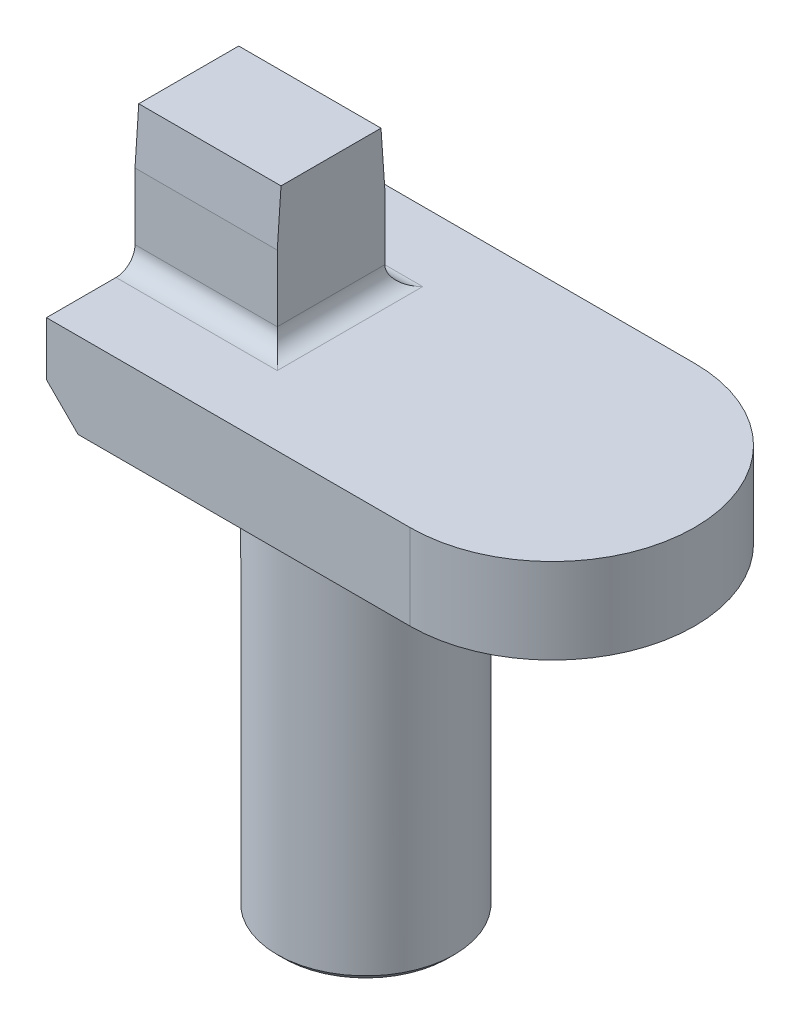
ISO-10303-21;
HEADER;
FILE_DESCRIPTION(('STEP AP214'),'2;1');
FILE_NAME('part.step','',(''),(''),'','','');
FILE_SCHEMA(('AUTOMOTIVE_DESIGN { 1 0 10303 214 1 1 1 1 }'));
ENDSEC;
DATA;
#1=APPLICATION_CONTEXT('core data for automotive mechanical design processes');
#2=APPLICATION_PROTOCOL_DEFINITION('international standard','automotive_design',2000,#1);
#3=PRODUCT_CONTEXT('',#1,'mechanical');
#4=PRODUCT('Part','Part','',(#3));
#5=PRODUCT_RELATED_PRODUCT_CATEGORY('part','',(#4));
#6=PRODUCT_DEFINITION_FORMATION('','',#4);
#7=PRODUCT_DEFINITION_CONTEXT('part definition',#1,'design');
#8=PRODUCT_DEFINITION('design','',#6,#7);
#9=PRODUCT_DEFINITION_SHAPE('','',#8);
#10=(LENGTH_UNIT() NAMED_UNIT(*) SI_UNIT(.MILLI.,.METRE.));
#11=(NAMED_UNIT(*) PLANE_ANGLE_UNIT() SI_UNIT($,.RADIAN.));
#12=(NAMED_UNIT(*) SI_UNIT($,.STERADIAN.) SOLID_ANGLE_UNIT());
#13=UNCERTAINTY_MEASURE_WITH_UNIT(LENGTH_MEASURE(1.E-05),#10,'distance_accuracy_value','');
#14=(GEOMETRIC_REPRESENTATION_CONTEXT(3) GLOBAL_UNCERTAINTY_ASSIGNED_CONTEXT((#13)) GLOBAL_UNIT_ASSIGNED_CONTEXT((#10,
#11,#12)) REPRESENTATION_CONTEXT('',''));
#15=CARTESIAN_POINT('',(0.,0.,0.));
#16=DIRECTION('',(0.,0.,1.));
#17=DIRECTION('',(1.,0.,0.));
#18=AXIS2_PLACEMENT_3D('',#15,#16,#17);
#19=CARTESIAN_POINT('',(7.493,3.429,0.));
#20=DIRECTION('',(0.,1.,0.));
#21=DIRECTION('',(0.,0.,1.));
#22=AXIS2_PLACEMENT_3D('',#19,#20,#21);
#23=PLANE('',#22);
#24=DIRECTION('',(0.,0.,1.));
#25=VECTOR('',#24,1.);
#26=CARTESIAN_POINT('',(-7.112,3.429,-5.715));
#27=LINE('',#26,#25);
#28=CARTESIAN_POINT('',(-7.112,3.429,-5.715));
#29=VERTEX_POINT('',#28);
#30=CARTESIAN_POINT('',(-7.112,3.429,-2.921));
#31=VERTEX_POINT('',#30);
#32=EDGE_CURVE('E167',#29,#31,#27,.T.);
#33=ORIENTED_EDGE('',*,*,#32,.T.);
#34=DIRECTION('',(1.,0.,0.));
#35=VECTOR('',#34,1.);
#36=CARTESIAN_POINT('',(7.493,3.429,-2.921));
#37=LINE('',#36,#35);
#38=CARTESIAN_POINT('',(-0.635,3.429,-2.921));
#39=VERTEX_POINT('',#38);
#40=EDGE_CURVE('E207',#31,#39,#37,.T.);
#41=ORIENTED_EDGE('',*,*,#40,.T.);
#42=DIRECTION('',(0.,0.,1.));
#43=VECTOR('',#42,1.);
#44=CARTESIAN_POINT('',(-0.635,3.429,0.));
#45=LINE('',#44,#43);
#46=CARTESIAN_POINT('',(-0.635,3.429,2.921));
#47=VERTEX_POINT('',#46);
#48=EDGE_CURVE('E204',#39,#47,#45,.T.);
#49=ORIENTED_EDGE('',*,*,#48,.T.);
#50=DIRECTION('',(-1.,0.,0.));
#51=VECTOR('',#50,1.);
#52=CARTESIAN_POINT('',(7.493,3.429,2.921));
#53=LINE('',#52,#51);
#54=CARTESIAN_POINT('',(-7.112,3.429,2.921));
#55=VERTEX_POINT('',#54);
#56=EDGE_CURVE('E202',#47,#55,#53,.T.);
#57=ORIENTED_EDGE('',*,*,#56,.T.);
#58=CARTESIAN_POINT('',(-7.112,3.429,5.715));
#59=VERTEX_POINT('',#58);
#60=EDGE_CURVE('E166',#55,#59,#27,.T.);
#61=ORIENTED_EDGE('',*,*,#60,.T.);
#62=DIRECTION('',(1.,0.,0.));
#63=VECTOR('',#62,1.);
#64=CARTESIAN_POINT('',(7.49300000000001,3.429,5.715));
#65=LINE('',#64,#63);
#66=CARTESIAN_POINT('',(7.49300000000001,3.429,5.715));
#67=VERTEX_POINT('',#66);
#68=EDGE_CURVE('E170',#59,#67,#65,.T.);
#69=ORIENTED_EDGE('',*,*,#68,.T.);
#70=CARTESIAN_POINT('',(7.493,3.429,0.));
#71=DIRECTION('',(0.,1.,0.));
#72=DIRECTION('',(0.,0.,1.));
#73=AXIS2_PLACEMENT_3D('',#70,#71,#72);
#74=CIRCLE('',#73,5.715);
#75=CARTESIAN_POINT('',(7.493,3.429,-5.715));
#76=VERTEX_POINT('',#75);
#77=EDGE_CURVE('E160',#67,#76,#74,.T.);
#78=ORIENTED_EDGE('',*,*,#77,.T.);
#79=DIRECTION('',(-1.,0.,0.));
#80=VECTOR('',#79,1.);
#81=CARTESIAN_POINT('',(7.493,3.429,-5.715));
#82=LINE('',#81,#80);
#83=EDGE_CURVE('E163',#76,#29,#82,.T.);
#84=ORIENTED_EDGE('',*,*,#83,.T.);
#85=EDGE_LOOP('',(#33,#41,#49,#57,#61,#69,#78,#84));
#86=FACE_BOUND('',#85,.T.);
#87=ADVANCED_FACE('F35',(#86),#23,.T.);
#88=CARTESIAN_POINT('',(7.493,3.429,0.));
#89=DIRECTION('',(0.,-1.,0.));
#90=DIRECTION('',(0.,0.,-1.));
#91=AXIS2_PLACEMENT_3D('',#88,#89,#90);
#92=CYLINDRICAL_SURFACE('',#91,5.715);
#93=CARTESIAN_POINT('',(7.493,0.,0.));
#94=DIRECTION('',(0.,1.,0.));
#95=DIRECTION('',(0.,0.,1.));
#96=AXIS2_PLACEMENT_3D('',#93,#94,#95);
#97=CIRCLE('',#96,5.715);
#98=CARTESIAN_POINT('',(7.49300000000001,0.,5.715));
#99=VERTEX_POINT('',#98);
#100=CARTESIAN_POINT('',(7.493,0.,-5.715));
#101=VERTEX_POINT('',#100);
#102=EDGE_CURVE('E150',#99,#101,#97,.T.);
#103=ORIENTED_EDGE('',*,*,#102,.T.);
#104=DIRECTION('',(0.,-1.,0.));
#105=VECTOR('',#104,1.);
#106=CARTESIAN_POINT('',(7.493,3.429,-5.715));
#107=LINE('',#106,#105);
#108=EDGE_CURVE('E184',#76,#101,#107,.T.);
#109=ORIENTED_EDGE('',*,*,#108,.F.);
#110=ORIENTED_EDGE('',*,*,#77,.F.);
#111=DIRECTION('',(0.,-1.,0.));
#112=VECTOR('',#111,1.);
#113=CARTESIAN_POINT('',(7.49300000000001,3.429,5.715));
#114=LINE('',#113,#112);
#115=EDGE_CURVE('E171',#67,#99,#114,.T.);
#116=ORIENTED_EDGE('',*,*,#115,.T.);
#117=EDGE_LOOP('',(#103,#109,#110,#116));
#118=FACE_BOUND('',#117,.T.);
#119=ADVANCED_FACE('F245',(#118),#92,.T.);
#120=CARTESIAN_POINT('',(7.493,3.429,-5.715));
#121=DIRECTION('',(0.,0.,1.));
#122=DIRECTION('',(1.,0.,0.));
#123=AXIS2_PLACEMENT_3D('',#120,#121,#122);
#124=PLANE('',#123);
#125=DIRECTION('',(-1.,0.,0.));
#126=VECTOR('',#125,1.);
#127=CARTESIAN_POINT('',(7.493,0.,-5.715));
#128=LINE('',#127,#126);
#129=CARTESIAN_POINT('',(-5.842,0.,-5.715));
#130=VERTEX_POINT('',#129);
#131=EDGE_CURVE('E154',#101,#130,#128,.T.);
#132=ORIENTED_EDGE('',*,*,#131,.T.);
#133=DIRECTION('',(0.707106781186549,-0.707106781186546,0.));
#134=VECTOR('',#133,1.);
#135=CARTESIAN_POINT('',(-7.112,1.27,-5.715));
#136=LINE('',#135,#134);
#137=CARTESIAN_POINT('',(-7.112,1.27,-5.715));
#138=VERTEX_POINT('',#137);
#139=EDGE_CURVE('E200',#130,#138,#136,.F.);
#140=ORIENTED_EDGE('',*,*,#139,.T.);
#141=DIRECTION('',(0.,-1.,0.));
#142=VECTOR('',#141,1.);
#143=CARTESIAN_POINT('',(-7.112,3.429,-5.715));
#144=LINE('',#143,#142);
#145=EDGE_CURVE('E181',#29,#138,#144,.T.);
#146=ORIENTED_EDGE('',*,*,#145,.F.);
#147=ORIENTED_EDGE('',*,*,#83,.F.);
#148=ORIENTED_EDGE('',*,*,#108,.T.);
#149=EDGE_LOOP('',(#132,#140,#146,#147,#148));
#150=FACE_BOUND('',#149,.T.);
#151=ADVANCED_FACE('F251',(#150),#124,.F.);
#152=CARTESIAN_POINT('',(-7.112,3.429,-5.715));
#153=DIRECTION('',(1.,0.,0.));
#154=DIRECTION('',(0.,0.,-1.));
#155=AXIS2_PLACEMENT_3D('',#152,#153,#154);
#156=PLANE('',#155);
#157=DIRECTION('',(0.,0.,1.));
#158=VECTOR('',#157,1.);
#159=CARTESIAN_POINT('',(-7.112,9.017,0.));
#160=LINE('',#159,#158);
#161=CARTESIAN_POINT('',(-7.112,9.017,-2.00802801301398));
#162=VERTEX_POINT('',#161);
#163=CARTESIAN_POINT('',(-7.112,9.017,2.00802801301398));
#164=VERTEX_POINT('',#163);
#165=EDGE_CURVE('E144',#162,#164,#160,.T.);
#166=ORIENTED_EDGE('',*,*,#165,.F.);
#167=DIRECTION('',(0.,0.997564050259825,0.069756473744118));
#168=VECTOR('',#167,1.);
#169=CARTESIAN_POINT('',(-7.112,6.858,-2.159));
#170=LINE('',#169,#168);
#171=CARTESIAN_POINT('',(-7.112,6.858,-2.159));
#172=VERTEX_POINT('',#171);
#173=EDGE_CURVE('E58',#172,#162,#170,.T.);
#174=ORIENTED_EDGE('',*,*,#173,.F.);
#175=DIRECTION('',(0.,-1.,0.));
#176=VECTOR('',#175,1.);
#177=CARTESIAN_POINT('',(-7.112,9.017,-2.159));
#178=LINE('',#177,#176);
#179=CARTESIAN_POINT('',(-7.112,4.191,-2.159));
#180=VERTEX_POINT('',#179);
#181=EDGE_CURVE('E140',#172,#180,#178,.T.);
#182=ORIENTED_EDGE('',*,*,#181,.T.);
#183=CARTESIAN_POINT('',(-7.112,4.191,-2.921));
#184=DIRECTION('',(1.,0.,0.));
#185=DIRECTION('',(0.,0.,-1.));
#186=AXIS2_PLACEMENT_3D('',#183,#184,#185);
#187=CIRCLE('',#186,0.762);
#188=EDGE_CURVE('E216',#180,#31,#187,.T.);
#189=ORIENTED_EDGE('',*,*,#188,.T.);
#190=ORIENTED_EDGE('',*,*,#32,.F.);
#191=ORIENTED_EDGE('',*,*,#145,.T.);
#192=DIRECTION('',(0.,0.,1.));
#193=VECTOR('',#192,1.);
#194=CARTESIAN_POINT('',(-7.112,1.27,-5.715));
#195=LINE('',#194,#193);
#196=CARTESIAN_POINT('',(-7.112,1.27,5.715));
#197=VERTEX_POINT('',#196);
#198=EDGE_CURVE('E193',#138,#197,#195,.T.);
#199=ORIENTED_EDGE('',*,*,#198,.T.);
#200=DIRECTION('',(0.,-1.,0.));
#201=VECTOR('',#200,1.);
#202=CARTESIAN_POINT('',(-7.112,3.429,5.715));
#203=LINE('',#202,#201);
#204=EDGE_CURVE('E178',#59,#197,#203,.T.);
#205=ORIENTED_EDGE('',*,*,#204,.F.);
#206=ORIENTED_EDGE('',*,*,#60,.F.);
#207=CARTESIAN_POINT('',(-7.112,4.191,2.921));
#208=DIRECTION('',(1.,0.,0.));
#209=DIRECTION('',(0.,0.,-1.));
#210=AXIS2_PLACEMENT_3D('',#207,#208,#209);
#211=CIRCLE('',#210,0.762);
#212=CARTESIAN_POINT('',(-7.112,4.191,2.159));
#213=VERTEX_POINT('',#212);
#214=EDGE_CURVE('E218',#55,#213,#211,.T.);
#215=ORIENTED_EDGE('',*,*,#214,.T.);
#216=DIRECTION('',(0.,-1.,0.));
#217=VECTOR('',#216,1.);
#218=CARTESIAN_POINT('',(-7.112,9.017,2.159));
#219=LINE('',#218,#217);
#220=CARTESIAN_POINT('',(-7.112,6.858,2.159));
#221=VERTEX_POINT('',#220);
#222=EDGE_CURVE('E151',#221,#213,#219,.T.);
#223=ORIENTED_EDGE('',*,*,#222,.F.);
#224=DIRECTION('',(0.,-0.997564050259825,0.069756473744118));
#225=VECTOR('',#224,1.);
#226=CARTESIAN_POINT('',(-7.112,6.858,2.159));
#227=LINE('',#226,#225);
#228=EDGE_CURVE('E327',#164,#221,#227,.T.);
#229=ORIENTED_EDGE('',*,*,#228,.F.);
#230=EDGE_LOOP('',(#166,#174,#182,#189,#190,#191,#199,#205,#206,#215,#223,#229));
#231=FACE_BOUND('',#230,.T.);
#232=ADVANCED_FACE('F139',(#231),#156,.F.);
#233=CARTESIAN_POINT('',(7.49300000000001,3.429,5.715));
#234=DIRECTION('',(0.,0.,-1.));
#235=DIRECTION('',(-1.,0.,0.));
#236=AXIS2_PLACEMENT_3D('',#233,#234,#235);
#237=PLANE('',#236);
#238=ORIENTED_EDGE('',*,*,#204,.T.);
#239=DIRECTION('',(-0.707106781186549,0.707106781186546,0.));
#240=VECTOR('',#239,1.);
#241=CARTESIAN_POINT('',(-7.112,1.27,5.715));
#242=LINE('',#241,#240);
#243=CARTESIAN_POINT('',(-5.84199999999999,0.,5.715));
#244=VERTEX_POINT('',#243);
#245=EDGE_CURVE('E196',#197,#244,#242,.F.);
#246=ORIENTED_EDGE('',*,*,#245,.T.);
#247=DIRECTION('',(1.,0.,0.));
#248=VECTOR('',#247,1.);
#249=CARTESIAN_POINT('',(7.49300000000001,0.,5.715));
#250=LINE('',#249,#248);
#251=EDGE_CURVE('E164',#244,#99,#250,.T.);
#252=ORIENTED_EDGE('',*,*,#251,.T.);
#253=ORIENTED_EDGE('',*,*,#115,.F.);
#254=ORIENTED_EDGE('',*,*,#68,.F.);
#255=EDGE_LOOP('',(#238,#246,#252,#253,#254));
#256=FACE_BOUND('',#255,.T.);
#257=ADVANCED_FACE('F260',(#256),#237,.F.);
#258=CARTESIAN_POINT('',(7.493,0.,0.));
#259=DIRECTION('',(0.,1.,0.));
#260=DIRECTION('',(0.,0.,1.));
#261=AXIS2_PLACEMENT_3D('',#258,#259,#260);
#262=PLANE('',#261);
#263=CARTESIAN_POINT('',(0.,0.,0.));
#264=DIRECTION('',(0.,1.,0.));
#265=DIRECTION('',(0.,0.,1.));
#266=AXIS2_PLACEMENT_3D('',#263,#264,#265);
#267=CIRCLE('',#266,4.318);
#268=CARTESIAN_POINT('',(0.,0.,4.318));
#269=VERTEX_POINT('',#268);
#270=EDGE_CURVE('E11',#269,#269,#267,.T.);
#271=ORIENTED_EDGE('',*,*,#270,.T.);
#272=EDGE_LOOP('',(#271));
#273=FACE_BOUND('',#272,.T.);
#274=ORIENTED_EDGE('',*,*,#251,.F.);
#275=DIRECTION('',(0.,0.,-1.));
#276=VECTOR('',#275,1.);
#277=CARTESIAN_POINT('',(-5.842,0.,0.));
#278=LINE('',#277,#276);
#279=EDGE_CURVE('E198',#244,#130,#278,.T.);
#280=ORIENTED_EDGE('',*,*,#279,.T.);
#281=ORIENTED_EDGE('',*,*,#131,.F.);
#282=ORIENTED_EDGE('',*,*,#102,.F.);
#283=EDGE_LOOP('',(#274,#280,#281,#282));
#284=FACE_BOUND('',#283,.T.);
#285=ADVANCED_FACE('F257',(#273,#284),#262,.F.);
#286=CARTESIAN_POINT('',(0.,-16.51,0.));
#287=DIRECTION('',(0.,1.,0.));
#288=DIRECTION('',(0.,0.,1.));
#289=AXIS2_PLACEMENT_3D('',#286,#287,#288);
#290=CYLINDRICAL_SURFACE('',#289,3.556);
#291=CARTESIAN_POINT('',(0.,-0.761999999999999,0.));
#292=DIRECTION('',(0.,1.,0.));
#293=DIRECTION('',(0.,0.,1.));
#294=AXIS2_PLACEMENT_3D('',#291,#292,#293);
#295=CIRCLE('',#294,3.556);
#296=CARTESIAN_POINT('',(0.,-0.761999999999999,3.556));
#297=VERTEX_POINT('',#296);
#298=EDGE_CURVE('E43',#297,#297,#295,.F.);
#299=ORIENTED_EDGE('',*,*,#298,.T.);
#300=EDGE_LOOP('',(#299));
#301=FACE_BOUND('',#300,.T.);
#302=CARTESIAN_POINT('',(0.,-16.256,0.));
#303=DIRECTION('',(0.,-1.,0.));
#304=DIRECTION('',(0.,0.,-1.));
#305=AXIS2_PLACEMENT_3D('',#302,#303,#304);
#306=CIRCLE('',#305,3.556);
#307=CARTESIAN_POINT('',(0.,-16.256,-3.556));
#308=VERTEX_POINT('',#307);
#309=EDGE_CURVE('E190',#308,#308,#306,.F.);
#310=ORIENTED_EDGE('',*,*,#309,.T.);
#311=EDGE_LOOP('',(#310));
#312=FACE_BOUND('',#311,.T.);
#313=ADVANCED_FACE('F228',(#301,#312),#290,.T.);
#314=CARTESIAN_POINT('',(0.,-16.51,0.));
#315=DIRECTION('',(0.,-1.,0.));
#316=DIRECTION('',(0.,0.,-1.));
#317=AXIS2_PLACEMENT_3D('',#314,#315,#316);
#318=PLANE('',#317);
#319=CARTESIAN_POINT('',(0.,-16.51,0.));
#320=DIRECTION('',(0.,-1.,0.));
#321=DIRECTION('',(0.,0.,-1.));
#322=AXIS2_PLACEMENT_3D('',#319,#320,#321);
#323=CIRCLE('',#322,3.302);
#324=CARTESIAN_POINT('',(0.,-16.51,-3.302));
#325=VERTEX_POINT('',#324);
#326=EDGE_CURVE('E187',#325,#325,#323,.T.);
#327=ORIENTED_EDGE('',*,*,#326,.T.);
#328=EDGE_LOOP('',(#327));
#329=FACE_BOUND('',#328,.T.);
#330=ADVANCED_FACE('F273',(#329),#318,.T.);
#331=CARTESIAN_POINT('',(0.,-16.51,0.));
#332=DIRECTION('',(0.,1.,0.));
#333=DIRECTION('',(0.,0.,1.));
#334=AXIS2_PLACEMENT_3D('',#331,#332,#333);
#335=CONICAL_SURFACE('',#334,3.302,0.785398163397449);
#336=ORIENTED_EDGE('',*,*,#309,.F.);
#337=EDGE_LOOP('',(#336));
#338=FACE_BOUND('',#337,.T.);
#339=ORIENTED_EDGE('',*,*,#326,.F.);
#340=EDGE_LOOP('',(#339));
#341=FACE_BOUND('',#340,.T.);
#342=ADVANCED_FACE('F270',(#338,#341),#335,.T.);
#343=CARTESIAN_POINT('',(7.493,9.017,-2.159));
#344=DIRECTION('',(0.,0.,1.));
#345=DIRECTION('',(1.,0.,0.));
#346=AXIS2_PLACEMENT_3D('',#343,#344,#345);
#347=PLANE('',#346);
#348=ORIENTED_EDGE('',*,*,#181,.F.);
#349=DIRECTION('',(-1.,0.,0.));
#350=VECTOR('',#349,1.);
#351=CARTESIAN_POINT('',(0.767272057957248,6.858,-2.159));
#352=LINE('',#351,#350);
#353=CARTESIAN_POINT('',(-1.397,6.858,-2.159));
#354=VERTEX_POINT('',#353);
#355=EDGE_CURVE('E128',#354,#172,#352,.T.);
#356=ORIENTED_EDGE('',*,*,#355,.F.);
#357=DIRECTION('',(0.,-1.,0.));
#358=VECTOR('',#357,1.);
#359=CARTESIAN_POINT('',(-1.397,9.017,-2.159));
#360=LINE('',#359,#358);
#361=CARTESIAN_POINT('',(-1.397,4.191,-2.159));
#362=VERTEX_POINT('',#361);
#363=EDGE_CURVE('E316',#354,#362,#360,.T.);
#364=ORIENTED_EDGE('',*,*,#363,.T.);
#365=DIRECTION('',(1.,0.,0.));
#366=VECTOR('',#365,1.);
#367=CARTESIAN_POINT('',(7.493,4.191,-2.159));
#368=LINE('',#367,#366);
#369=EDGE_CURVE('E148',#362,#180,#368,.F.);
#370=ORIENTED_EDGE('',*,*,#369,.T.);
#371=EDGE_LOOP('',(#348,#356,#364,#370));
#372=FACE_BOUND('',#371,.T.);
#373=ADVANCED_FACE('F146',(#372),#347,.F.);
#374=CARTESIAN_POINT('',(7.493,9.017,2.159));
#375=DIRECTION('',(0.,0.,-1.));
#376=DIRECTION('',(-1.,0.,0.));
#377=AXIS2_PLACEMENT_3D('',#374,#375,#376);
#378=PLANE('',#377);
#379=DIRECTION('',(0.,-1.,0.));
#380=VECTOR('',#379,1.);
#381=CARTESIAN_POINT('',(-1.397,9.017,2.159));
#382=LINE('',#381,#380);
#383=CARTESIAN_POINT('',(-1.397,6.858,2.159));
#384=VERTEX_POINT('',#383);
#385=CARTESIAN_POINT('',(-1.397,4.191,2.159));
#386=VERTEX_POINT('',#385);
#387=EDGE_CURVE('E156',#384,#386,#382,.T.);
#388=ORIENTED_EDGE('',*,*,#387,.F.);
#389=DIRECTION('',(-1.,0.,0.));
#390=VECTOR('',#389,1.);
#391=CARTESIAN_POINT('',(0.767272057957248,6.858,2.159));
#392=LINE('',#391,#390);
#393=EDGE_CURVE('E324',#384,#221,#392,.T.);
#394=ORIENTED_EDGE('',*,*,#393,.T.);
#395=ORIENTED_EDGE('',*,*,#222,.T.);
#396=DIRECTION('',(-1.,0.,0.));
#397=VECTOR('',#396,1.);
#398=CARTESIAN_POINT('',(7.493,4.191,2.159));
#399=LINE('',#398,#397);
#400=EDGE_CURVE('E213',#213,#386,#399,.F.);
#401=ORIENTED_EDGE('',*,*,#400,.T.);
#402=EDGE_LOOP('',(#388,#394,#395,#401));
#403=FACE_BOUND('',#402,.T.);
#404=ADVANCED_FACE('F311',(#403),#378,.F.);
#405=CARTESIAN_POINT('',(-1.397,9.017,0.));
#406=DIRECTION('',(-1.,0.,0.));
#407=DIRECTION('',(0.,0.,1.));
#408=AXIS2_PLACEMENT_3D('',#405,#406,#407);
#409=PLANE('',#408);
#410=ORIENTED_EDGE('',*,*,#363,.F.);
#411=DIRECTION('',(0.,-0.997564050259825,-0.069756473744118));
#412=VECTOR('',#411,1.);
#413=CARTESIAN_POINT('',(-1.397,6.858,-2.159));
#414=LINE('',#413,#412);
#415=CARTESIAN_POINT('',(-1.397,9.017,-2.00802801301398));
#416=VERTEX_POINT('',#415);
#417=EDGE_CURVE('E131',#416,#354,#414,.T.);
#418=ORIENTED_EDGE('',*,*,#417,.F.);
#419=DIRECTION('',(0.,0.,-1.));
#420=VECTOR('',#419,1.);
#421=CARTESIAN_POINT('',(-1.397,9.017,0.));
#422=LINE('',#421,#420);
#423=CARTESIAN_POINT('',(-1.397,9.017,2.00802801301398));
#424=VERTEX_POINT('',#423);
#425=EDGE_CURVE('E318',#424,#416,#422,.T.);
#426=ORIENTED_EDGE('',*,*,#425,.F.);
#427=DIRECTION('',(0.,0.997564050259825,-0.069756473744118));
#428=VECTOR('',#427,1.);
#429=CARTESIAN_POINT('',(-1.397,6.858,2.159));
#430=LINE('',#429,#428);
#431=EDGE_CURVE('E50',#384,#424,#430,.T.);
#432=ORIENTED_EDGE('',*,*,#431,.F.);
#433=ORIENTED_EDGE('',*,*,#387,.T.);
#434=DIRECTION('',(0.,0.,1.));
#435=VECTOR('',#434,1.);
#436=CARTESIAN_POINT('',(-1.397,4.191,0.));
#437=LINE('',#436,#435);
#438=EDGE_CURVE('E209',#386,#362,#437,.F.);
#439=ORIENTED_EDGE('',*,*,#438,.T.);
#440=EDGE_LOOP('',(#410,#418,#426,#432,#433,#439));
#441=FACE_BOUND('',#440,.T.);
#442=ADVANCED_FACE('F315',(#441),#409,.F.);
#443=CARTESIAN_POINT('',(0.,9.017,0.));
#444=DIRECTION('',(0.,1.,0.));
#445=DIRECTION('',(0.,0.,1.));
#446=AXIS2_PLACEMENT_3D('',#443,#444,#445);
#447=PLANE('',#446);
#448=DIRECTION('',(-1.,0.,0.));
#449=VECTOR('',#448,1.);
#450=CARTESIAN_POINT('',(0.767272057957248,9.017,-2.00802801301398));
#451=LINE('',#450,#449);
#452=EDGE_CURVE('E135',#416,#162,#451,.T.);
#453=ORIENTED_EDGE('',*,*,#452,.T.);
#454=ORIENTED_EDGE('',*,*,#165,.T.);
#455=DIRECTION('',(-1.,0.,0.));
#456=VECTOR('',#455,1.);
#457=CARTESIAN_POINT('',(0.767272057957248,9.017,2.00802801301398));
#458=LINE('',#457,#456);
#459=EDGE_CURVE('E326',#424,#164,#458,.T.);
#460=ORIENTED_EDGE('',*,*,#459,.F.);
#461=ORIENTED_EDGE('',*,*,#425,.T.);
#462=EDGE_LOOP('',(#453,#454,#460,#461));
#463=FACE_BOUND('',#462,.T.);
#464=ADVANCED_FACE('F278',(#463),#447,.T.);
#465=CARTESIAN_POINT('',(-7.112,1.27,-5.715));
#466=DIRECTION('',(0.707106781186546,0.707106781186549,0.));
#467=DIRECTION('',(0.,0.,1.));
#468=AXIS2_PLACEMENT_3D('',#465,#466,#467);
#469=PLANE('',#468);
#470=ORIENTED_EDGE('',*,*,#139,.F.);
#471=ORIENTED_EDGE('',*,*,#279,.F.);
#472=ORIENTED_EDGE('',*,*,#245,.F.);
#473=ORIENTED_EDGE('',*,*,#198,.F.);
#474=EDGE_LOOP('',(#470,#471,#472,#473));
#475=FACE_BOUND('',#474,.T.);
#476=ADVANCED_FACE('F275',(#475),#469,.F.);
#477=CARTESIAN_POINT('',(7.493,4.191,-2.921));
#478=DIRECTION('',(1.,0.,0.));
#479=DIRECTION('',(0.,0.,-1.));
#480=AXIS2_PLACEMENT_3D('',#477,#478,#479);
#481=CYLINDRICAL_SURFACE('',#480,0.762);
#482=ORIENTED_EDGE('',*,*,#188,.F.);
#483=ORIENTED_EDGE('',*,*,#369,.F.);
#484=CARTESIAN_POINT('',(-0.635,4.191,-2.921));
#485=DIRECTION('',(0.707106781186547,0.,0.707106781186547));
#486=DIRECTION('',(0.707106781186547,0.,-0.707106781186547));
#487=AXIS2_PLACEMENT_3D('',#484,#485,#486);
#488=ELLIPSE('',#487,1.0776307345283,0.762);
#489=EDGE_CURVE('E223',#39,#362,#488,.F.);
#490=ORIENTED_EDGE('',*,*,#489,.F.);
#491=ORIENTED_EDGE('',*,*,#40,.F.);
#492=EDGE_LOOP('',(#482,#483,#490,#491));
#493=FACE_BOUND('',#492,.T.);
#494=ADVANCED_FACE('F277',(#493),#481,.F.);
#495=CARTESIAN_POINT('',(7.493,4.191,2.921));
#496=DIRECTION('',(-1.,0.,0.));
#497=DIRECTION('',(0.,0.,1.));
#498=AXIS2_PLACEMENT_3D('',#495,#496,#497);
#499=CYLINDRICAL_SURFACE('',#498,0.762);
#500=ORIENTED_EDGE('',*,*,#214,.F.);
#501=ORIENTED_EDGE('',*,*,#56,.F.);
#502=CARTESIAN_POINT('',(-0.635,4.191,2.921));
#503=DIRECTION('',(-0.707106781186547,0.,0.707106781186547));
#504=DIRECTION('',(-0.707106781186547,0.,-0.707106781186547));
#505=AXIS2_PLACEMENT_3D('',#502,#503,#504);
#506=ELLIPSE('',#505,1.0776307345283,0.762);
#507=EDGE_CURVE('E221',#386,#47,#506,.T.);
#508=ORIENTED_EDGE('',*,*,#507,.F.);
#509=ORIENTED_EDGE('',*,*,#400,.F.);
#510=EDGE_LOOP('',(#500,#501,#508,#509));
#511=FACE_BOUND('',#510,.T.);
#512=ADVANCED_FACE('F240',(#511),#499,.F.);
#513=CARTESIAN_POINT('',(-0.635,4.191,0.));
#514=DIRECTION('',(0.,0.,1.));
#515=DIRECTION('',(1.,0.,0.));
#516=AXIS2_PLACEMENT_3D('',#513,#514,#515);
#517=CYLINDRICAL_SURFACE('',#516,0.762);
#518=ORIENTED_EDGE('',*,*,#489,.T.);
#519=ORIENTED_EDGE('',*,*,#438,.F.);
#520=ORIENTED_EDGE('',*,*,#507,.T.);
#521=ORIENTED_EDGE('',*,*,#48,.F.);
#522=EDGE_LOOP('',(#518,#519,#520,#521));
#523=FACE_BOUND('',#522,.T.);
#524=ADVANCED_FACE('F233',(#523),#517,.F.);
#525=CARTESIAN_POINT('',(0.,-0.761999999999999,0.));
#526=DIRECTION('',(0.,1.,0.));
#527=DIRECTION('',(0.,0.,1.));
#528=AXIS2_PLACEMENT_3D('',#525,#526,#527);
#529=TOROIDAL_SURFACE('',#528,4.318,0.762);
#530=ORIENTED_EDGE('',*,*,#270,.F.);
#531=EDGE_LOOP('',(#530));
#532=FACE_BOUND('',#531,.T.);
#533=ORIENTED_EDGE('',*,*,#298,.F.);
#534=EDGE_LOOP('',(#533));
#535=FACE_BOUND('',#534,.T.);
#536=ADVANCED_FACE('F37',(#532,#535),#529,.F.);
#537=CARTESIAN_POINT('',(0.767272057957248,6.858,2.159));
#538=DIRECTION('',(0.,-0.069756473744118,-0.997564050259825));
#539=DIRECTION('',(0.,0.997564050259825,-0.069756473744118));
#540=AXIS2_PLACEMENT_3D('',#537,#538,#539);
#541=PLANE('',#540);
#542=ORIENTED_EDGE('',*,*,#431,.T.);
#543=ORIENTED_EDGE('',*,*,#459,.T.);
#544=ORIENTED_EDGE('',*,*,#228,.T.);
#545=ORIENTED_EDGE('',*,*,#393,.F.);
#546=EDGE_LOOP('',(#542,#543,#544,#545));
#547=FACE_BOUND('',#546,.T.);
#548=ADVANCED_FACE('F232',(#547),#541,.F.);
#549=CARTESIAN_POINT('',(0.767272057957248,6.858,-2.159));
#550=DIRECTION('',(0.,-0.069756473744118,0.997564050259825));
#551=DIRECTION('',(0.,-0.997564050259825,-0.069756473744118));
#552=AXIS2_PLACEMENT_3D('',#549,#550,#551);
#553=PLANE('',#552);
#554=ORIENTED_EDGE('',*,*,#417,.T.);
#555=ORIENTED_EDGE('',*,*,#355,.T.);
#556=ORIENTED_EDGE('',*,*,#173,.T.);
#557=ORIENTED_EDGE('',*,*,#452,.F.);
#558=EDGE_LOOP('',(#554,#555,#556,#557));
#559=FACE_BOUND('',#558,.T.);
#560=ADVANCED_FACE('F129',(#559),#553,.F.);
#561=CLOSED_SHELL('',(#87,#119,#151,#232,#257,#285,#313,#330,#342,#373,#404,#442,#464,#476,#494,
#512,#524,#536,#548,#560));
#562=MANIFOLD_SOLID_BREP('B2',#561);
#563=ADVANCED_BREP_SHAPE_REPRESENTATION('',(#18,#562),#14);
#564=SHAPE_DEFINITION_REPRESENTATION(#9,#563);
ENDSEC;
END-ISO-10303-21;
